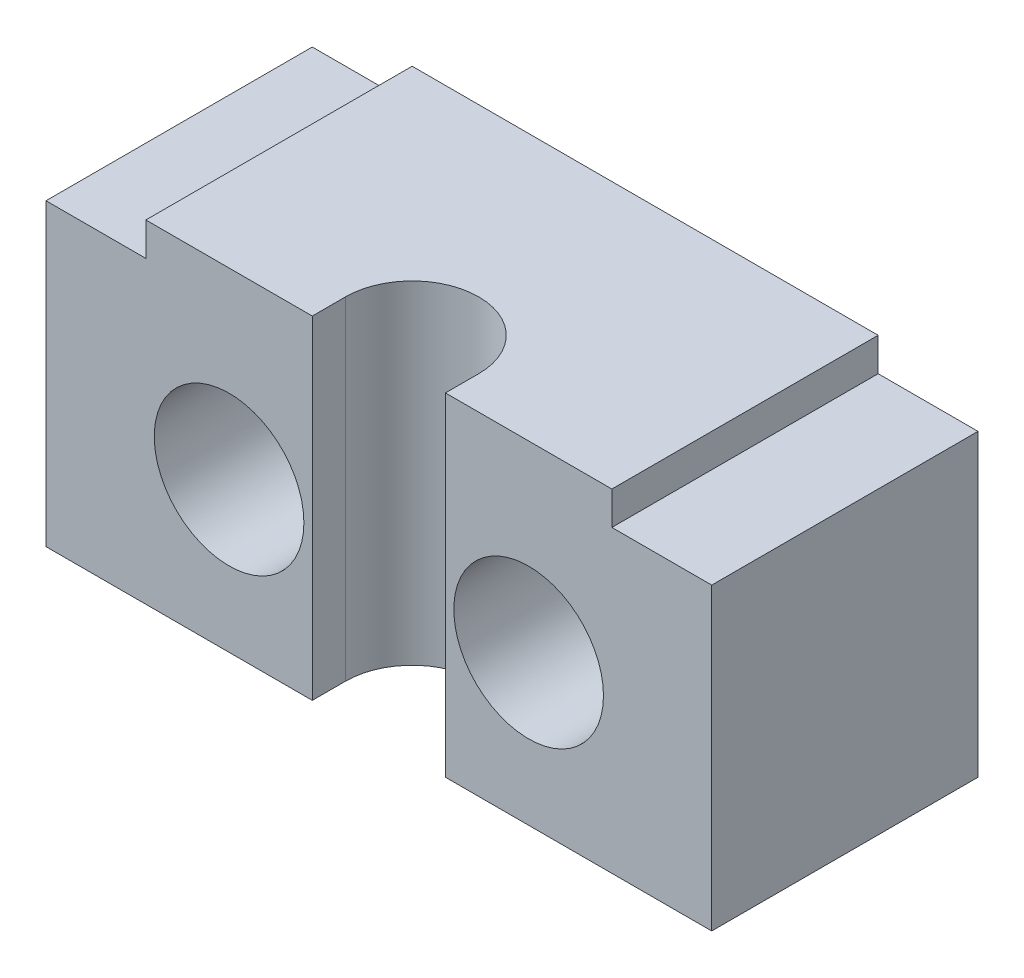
ISO-10303-21;
HEADER;
FILE_DESCRIPTION(('STEP AP214'),'2;1');
FILE_NAME('part.step','',(''),(''),'','','');
FILE_SCHEMA(('AUTOMOTIVE_DESIGN { 1 0 10303 214 1 1 1 1 }'));
ENDSEC;
DATA;
#1=APPLICATION_CONTEXT('core data for automotive mechanical design processes');
#2=APPLICATION_PROTOCOL_DEFINITION('international standard','automotive_design',2000,#1);
#3=PRODUCT_CONTEXT('',#1,'mechanical');
#4=PRODUCT('Part','Part','',(#3));
#5=PRODUCT_RELATED_PRODUCT_CATEGORY('part','',(#4));
#6=PRODUCT_DEFINITION_FORMATION('','',#4);
#7=PRODUCT_DEFINITION_CONTEXT('part definition',#1,'design');
#8=PRODUCT_DEFINITION('design','',#6,#7);
#9=PRODUCT_DEFINITION_SHAPE('','',#8);
#10=(LENGTH_UNIT() NAMED_UNIT(*) SI_UNIT(.MILLI.,.METRE.));
#11=(NAMED_UNIT(*) PLANE_ANGLE_UNIT() SI_UNIT($,.RADIAN.));
#12=(NAMED_UNIT(*) SI_UNIT($,.STERADIAN.) SOLID_ANGLE_UNIT());
#13=UNCERTAINTY_MEASURE_WITH_UNIT(LENGTH_MEASURE(1.E-05),#10,'distance_accuracy_value','');
#14=(GEOMETRIC_REPRESENTATION_CONTEXT(3) GLOBAL_UNCERTAINTY_ASSIGNED_CONTEXT((#13)) GLOBAL_UNIT_ASSIGNED_CONTEXT((#10,
#11,#12)) REPRESENTATION_CONTEXT('',''));
#15=CARTESIAN_POINT('',(0.,0.,0.));
#16=DIRECTION('',(0.,0.,1.));
#17=DIRECTION('',(1.,0.,0.));
#18=AXIS2_PLACEMENT_3D('',#15,#16,#17);
#19=CARTESIAN_POINT('',(0.,0.,25.4));
#20=DIRECTION('',(0.,0.,1.));
#21=DIRECTION('',(1.,0.,0.));
#22=AXIS2_PLACEMENT_3D('',#19,#20,#21);
#23=PLANE('',#22);
#24=CARTESIAN_POINT('',(14.2875,14.2748,25.4));
#25=DIRECTION('',(0.,0.,1.));
#26=DIRECTION('',(1.,0.,0.));
#27=AXIS2_PLACEMENT_3D('',#24,#25,#26);
#28=CIRCLE('',#27,7.1374);
#29=CARTESIAN_POINT('',(21.4249,14.2748,25.4));
#30=VERTEX_POINT('',#29);
#31=EDGE_CURVE('E184',#30,#30,#28,.F.);
#32=ORIENTED_EDGE('',*,*,#31,.T.);
#33=EDGE_LOOP('',(#32));
#34=FACE_BOUND('',#33,.T.);
#35=DIRECTION('',(-1.,0.,0.));
#36=VECTOR('',#35,1.);
#37=CARTESIAN_POINT('',(22.225,31.75,25.4));
#38=LINE('',#37,#36);
#39=CARTESIAN_POINT('',(22.225,31.75,25.4));
#40=VERTEX_POINT('',#39);
#41=CARTESIAN_POINT('',(6.35,31.75,25.4));
#42=VERTEX_POINT('',#41);
#43=EDGE_CURVE('E127',#40,#42,#38,.T.);
#44=ORIENTED_EDGE('',*,*,#43,.T.);
#45=DIRECTION('',(0.,-1.,0.));
#46=VECTOR('',#45,1.);
#47=CARTESIAN_POINT('',(6.35,0.,25.4));
#48=LINE('',#47,#46);
#49=CARTESIAN_POINT('',(6.35,0.,25.4));
#50=VERTEX_POINT('',#49);
#51=EDGE_CURVE('E218',#42,#50,#48,.T.);
#52=ORIENTED_EDGE('',*,*,#51,.T.);
#53=DIRECTION('',(1.,0.,0.));
#54=VECTOR('',#53,1.);
#55=CARTESIAN_POINT('',(-31.75,0.,25.4));
#56=LINE('',#55,#54);
#57=CARTESIAN_POINT('',(31.75,0.,25.4));
#58=VERTEX_POINT('',#57);
#59=EDGE_CURVE('E241',#50,#58,#56,.T.);
#60=ORIENTED_EDGE('',*,*,#59,.T.);
#61=DIRECTION('',(0.,1.,0.));
#62=VECTOR('',#61,1.);
#63=CARTESIAN_POINT('',(31.75,0.,25.4));
#64=LINE('',#63,#62);
#65=CARTESIAN_POINT('',(31.75,28.575,25.4));
#66=VERTEX_POINT('',#65);
#67=EDGE_CURVE('E247',#58,#66,#64,.T.);
#68=ORIENTED_EDGE('',*,*,#67,.T.);
#69=DIRECTION('',(-1.,0.,0.));
#70=VECTOR('',#69,1.);
#71=CARTESIAN_POINT('',(31.75,28.575,25.4));
#72=LINE('',#71,#70);
#73=CARTESIAN_POINT('',(22.225,28.575,25.4));
#74=VERTEX_POINT('',#73);
#75=EDGE_CURVE('E227',#66,#74,#72,.T.);
#76=ORIENTED_EDGE('',*,*,#75,.T.);
#77=DIRECTION('',(0.,1.,0.));
#78=VECTOR('',#77,1.);
#79=CARTESIAN_POINT('',(22.225,28.575,25.4));
#80=LINE('',#79,#78);
#81=EDGE_CURVE('E128',#74,#40,#80,.T.);
#82=ORIENTED_EDGE('',*,*,#81,.T.);
#83=EDGE_LOOP('',(#44,#52,#60,#68,#76,#82));
#84=FACE_BOUND('',#83,.T.);
#85=ADVANCED_FACE('F33',(#34,#84),#23,.T.);
#86=CARTESIAN_POINT('',(-14.2875,14.2748,25.4));
#87=DIRECTION('',(0.,0.,1.));
#88=DIRECTION('',(1.,0.,0.));
#89=AXIS2_PLACEMENT_3D('',#86,#87,#88);
#90=CIRCLE('',#89,7.1374);
#91=CARTESIAN_POINT('',(-7.1501,14.2748,25.4));
#92=VERTEX_POINT('',#91);
#93=EDGE_CURVE('E192',#92,#92,#90,.F.);
#94=ORIENTED_EDGE('',*,*,#93,.T.);
#95=EDGE_LOOP('',(#94));
#96=FACE_BOUND('',#95,.T.);
#97=CARTESIAN_POINT('',(-31.75,0.,25.4));
#98=VERTEX_POINT('',#97);
#99=CARTESIAN_POINT('',(-6.35,0.,25.4));
#100=VERTEX_POINT('',#99);
#101=EDGE_CURVE('E99',#98,#100,#56,.T.);
#102=ORIENTED_EDGE('',*,*,#101,.T.);
#103=DIRECTION('',(0.,1.,0.));
#104=VECTOR('',#103,1.);
#105=CARTESIAN_POINT('',(-6.35,0.,25.4));
#106=LINE('',#105,#104);
#107=CARTESIAN_POINT('',(-6.35,31.75,25.4));
#108=VERTEX_POINT('',#107);
#109=EDGE_CURVE('E124',#100,#108,#106,.T.);
#110=ORIENTED_EDGE('',*,*,#109,.T.);
#111=CARTESIAN_POINT('',(-22.225,31.75,25.4));
#112=VERTEX_POINT('',#111);
#113=EDGE_CURVE('E116',#108,#112,#38,.T.);
#114=ORIENTED_EDGE('',*,*,#113,.T.);
#115=DIRECTION('',(0.,-1.,0.));
#116=VECTOR('',#115,1.);
#117=CARTESIAN_POINT('',(-22.225,31.75,25.4));
#118=LINE('',#117,#116);
#119=CARTESIAN_POINT('',(-22.225,28.575,25.4));
#120=VERTEX_POINT('',#119);
#121=EDGE_CURVE('E120',#112,#120,#118,.T.);
#122=ORIENTED_EDGE('',*,*,#121,.T.);
#123=DIRECTION('',(-1.,0.,0.));
#124=VECTOR('',#123,1.);
#125=CARTESIAN_POINT('',(-22.225,28.575,25.4));
#126=LINE('',#125,#124);
#127=CARTESIAN_POINT('',(-31.75,28.575,25.4));
#128=VERTEX_POINT('',#127);
#129=EDGE_CURVE('E57',#120,#128,#126,.T.);
#130=ORIENTED_EDGE('',*,*,#129,.T.);
#131=DIRECTION('',(0.,-1.,0.));
#132=VECTOR('',#131,1.);
#133=CARTESIAN_POINT('',(-31.75,28.575,25.4));
#134=LINE('',#133,#132);
#135=EDGE_CURVE('E165',#128,#98,#134,.T.);
#136=ORIENTED_EDGE('',*,*,#135,.T.);
#137=EDGE_LOOP('',(#102,#110,#114,#122,#130,#136));
#138=FACE_BOUND('',#137,.T.);
#139=ADVANCED_FACE('F118',(#96,#138),#23,.T.);
#140=CARTESIAN_POINT('',(0.,0.,25.4));
#141=DIRECTION('',(0.,1.,0.));
#142=DIRECTION('',(0.,0.,1.));
#143=AXIS2_PLACEMENT_3D('',#140,#141,#142);
#144=PLANE('',#143);
#145=DIRECTION('',(0.,0.,-1.));
#146=VECTOR('',#145,1.);
#147=CARTESIAN_POINT('',(6.35,0.,34.925));
#148=LINE('',#147,#146);
#149=CARTESIAN_POINT('',(6.35,0.,22.225));
#150=VERTEX_POINT('',#149);
#151=EDGE_CURVE('E216',#50,#150,#148,.T.);
#152=ORIENTED_EDGE('',*,*,#151,.T.);
#153=CARTESIAN_POINT('',(0.,0.,22.225));
#154=DIRECTION('',(0.,1.,0.));
#155=DIRECTION('',(0.,0.,1.));
#156=AXIS2_PLACEMENT_3D('',#153,#154,#155);
#157=CIRCLE('',#156,6.35);
#158=CARTESIAN_POINT('',(-6.35,0.,22.225));
#159=VERTEX_POINT('',#158);
#160=EDGE_CURVE('E392',#150,#159,#157,.T.);
#161=ORIENTED_EDGE('',*,*,#160,.T.);
#162=DIRECTION('',(0.,0.,1.));
#163=VECTOR('',#162,1.);
#164=CARTESIAN_POINT('',(-6.35,0.,34.925));
#165=LINE('',#164,#163);
#166=EDGE_CURVE('E390',#159,#100,#165,.T.);
#167=ORIENTED_EDGE('',*,*,#166,.T.);
#168=ORIENTED_EDGE('',*,*,#101,.F.);
#169=DIRECTION('',(0.,0.,-1.));
#170=VECTOR('',#169,1.);
#171=CARTESIAN_POINT('',(-31.75,0.,25.4));
#172=LINE('',#171,#170);
#173=CARTESIAN_POINT('',(-31.75,0.,0.));
#174=VERTEX_POINT('',#173);
#175=EDGE_CURVE('E178',#98,#174,#172,.T.);
#176=ORIENTED_EDGE('',*,*,#175,.T.);
#177=DIRECTION('',(1.,0.,0.));
#178=VECTOR('',#177,1.);
#179=CARTESIAN_POINT('',(0.,0.,0.));
#180=LINE('',#179,#178);
#181=CARTESIAN_POINT('',(31.75,0.,0.));
#182=VERTEX_POINT('',#181);
#183=EDGE_CURVE('E152',#174,#182,#180,.T.);
#184=ORIENTED_EDGE('',*,*,#183,.T.);
#185=DIRECTION('',(0.,0.,-1.));
#186=VECTOR('',#185,1.);
#187=CARTESIAN_POINT('',(31.75,0.,25.4));
#188=LINE('',#187,#186);
#189=EDGE_CURVE('E175',#58,#182,#188,.T.);
#190=ORIENTED_EDGE('',*,*,#189,.F.);
#191=ORIENTED_EDGE('',*,*,#59,.F.);
#192=EDGE_LOOP('',(#152,#161,#167,#168,#176,#184,#190,#191));
#193=FACE_BOUND('',#192,.T.);
#194=ADVANCED_FACE('F257',(#193),#144,.F.);
#195=CARTESIAN_POINT('',(22.225,31.75,25.4));
#196=DIRECTION('',(0.,-1.,0.));
#197=DIRECTION('',(0.,0.,-1.));
#198=AXIS2_PLACEMENT_3D('',#195,#196,#197);
#199=PLANE('',#198);
#200=DIRECTION('',(0.,0.,-1.));
#201=VECTOR('',#200,1.);
#202=CARTESIAN_POINT('',(6.35,31.75,25.4));
#203=LINE('',#202,#201);
#204=CARTESIAN_POINT('',(6.35,31.75,22.225));
#205=VERTEX_POINT('',#204);
#206=EDGE_CURVE('E11',#42,#205,#203,.T.);
#207=ORIENTED_EDGE('',*,*,#206,.F.);
#208=ORIENTED_EDGE('',*,*,#43,.F.);
#209=DIRECTION('',(0.,0.,-1.));
#210=VECTOR('',#209,1.);
#211=CARTESIAN_POINT('',(22.225,31.75,25.4));
#212=LINE('',#211,#210);
#213=CARTESIAN_POINT('',(22.225,31.75,0.));
#214=VERTEX_POINT('',#213);
#215=EDGE_CURVE('E139',#40,#214,#212,.T.);
#216=ORIENTED_EDGE('',*,*,#215,.T.);
#217=DIRECTION('',(-1.,0.,0.));
#218=VECTOR('',#217,1.);
#219=CARTESIAN_POINT('',(22.225,31.75,0.));
#220=LINE('',#219,#218);
#221=CARTESIAN_POINT('',(-22.225,31.75,0.));
#222=VERTEX_POINT('',#221);
#223=EDGE_CURVE('E136',#214,#222,#220,.T.);
#224=ORIENTED_EDGE('',*,*,#223,.T.);
#225=DIRECTION('',(0.,0.,-1.));
#226=VECTOR('',#225,1.);
#227=CARTESIAN_POINT('',(-22.225,31.75,25.4));
#228=LINE('',#227,#226);
#229=EDGE_CURVE('E131',#112,#222,#228,.T.);
#230=ORIENTED_EDGE('',*,*,#229,.F.);
#231=ORIENTED_EDGE('',*,*,#113,.F.);
#232=DIRECTION('',(0.,0.,1.));
#233=VECTOR('',#232,1.);
#234=CARTESIAN_POINT('',(-6.35,31.75,25.4));
#235=LINE('',#234,#233);
#236=CARTESIAN_POINT('',(-6.35,31.75,22.225));
#237=VERTEX_POINT('',#236);
#238=EDGE_CURVE('E180',#237,#108,#235,.T.);
#239=ORIENTED_EDGE('',*,*,#238,.F.);
#240=CARTESIAN_POINT('',(0.,31.75,22.225));
#241=DIRECTION('',(0.,-1.,0.));
#242=DIRECTION('',(0.,0.,-1.));
#243=AXIS2_PLACEMENT_3D('',#240,#241,#242);
#244=CIRCLE('',#243,6.35);
#245=EDGE_CURVE('E41',#205,#237,#244,.F.);
#246=ORIENTED_EDGE('',*,*,#245,.F.);
#247=EDGE_LOOP('',(#207,#208,#216,#224,#230,#231,#239,#246));
#248=FACE_BOUND('',#247,.T.);
#249=ADVANCED_FACE('F133',(#248),#199,.F.);
#250=CARTESIAN_POINT('',(-14.2875,14.2748,25.4));
#251=DIRECTION('',(0.,0.,-1.));
#252=DIRECTION('',(-1.,0.,0.));
#253=AXIS2_PLACEMENT_3D('',#250,#251,#252);
#254=CYLINDRICAL_SURFACE('',#253,4.7625);
#255=CARTESIAN_POINT('',(-14.2875,14.2748,0.));
#256=DIRECTION('',(0.,0.,1.));
#257=DIRECTION('',(1.,0.,0.));
#258=AXIS2_PLACEMENT_3D('',#255,#256,#257);
#259=CIRCLE('',#258,4.7625);
#260=CARTESIAN_POINT('',(-9.525,14.2748,0.));
#261=VERTEX_POINT('',#260);
#262=EDGE_CURVE('E153',#261,#261,#259,.T.);
#263=ORIENTED_EDGE('',*,*,#262,.F.);
#264=EDGE_LOOP('',(#263));
#265=FACE_BOUND('',#264,.T.);
#266=CARTESIAN_POINT('',(-14.2875,14.2748,11.1252));
#267=DIRECTION('',(0.,0.,1.));
#268=DIRECTION('',(1.,0.,0.));
#269=AXIS2_PLACEMENT_3D('',#266,#267,#268);
#270=CIRCLE('',#269,4.7625);
#271=CARTESIAN_POINT('',(-9.525,14.2748,11.1252));
#272=VERTEX_POINT('',#271);
#273=EDGE_CURVE('E189',#272,#272,#270,.T.);
#274=ORIENTED_EDGE('',*,*,#273,.T.);
#275=EDGE_LOOP('',(#274));
#276=FACE_BOUND('',#275,.T.);
#277=ADVANCED_FACE('F265',(#265,#276),#254,.F.);
#278=CARTESIAN_POINT('',(14.2875,14.2748,25.4));
#279=DIRECTION('',(0.,0.,-1.));
#280=DIRECTION('',(-1.,0.,0.));
#281=AXIS2_PLACEMENT_3D('',#278,#279,#280);
#282=CYLINDRICAL_SURFACE('',#281,4.7625);
#283=CARTESIAN_POINT('',(14.2875,14.2748,0.));
#284=DIRECTION('',(0.,0.,1.));
#285=DIRECTION('',(1.,0.,0.));
#286=AXIS2_PLACEMENT_3D('',#283,#284,#285);
#287=CIRCLE('',#286,4.7625);
#288=CARTESIAN_POINT('',(19.05,14.2748,0.));
#289=VERTEX_POINT('',#288);
#290=EDGE_CURVE('E188',#289,#289,#287,.T.);
#291=ORIENTED_EDGE('',*,*,#290,.F.);
#292=EDGE_LOOP('',(#291));
#293=FACE_BOUND('',#292,.T.);
#294=CARTESIAN_POINT('',(14.2875,14.2748,11.1252));
#295=DIRECTION('',(0.,0.,1.));
#296=DIRECTION('',(1.,0.,0.));
#297=AXIS2_PLACEMENT_3D('',#294,#295,#296);
#298=CIRCLE('',#297,4.7625);
#299=CARTESIAN_POINT('',(19.05,14.2748,11.1252));
#300=VERTEX_POINT('',#299);
#301=EDGE_CURVE('E181',#300,#300,#298,.T.);
#302=ORIENTED_EDGE('',*,*,#301,.T.);
#303=EDGE_LOOP('',(#302));
#304=FACE_BOUND('',#303,.T.);
#305=ADVANCED_FACE('F279',(#293,#304),#282,.F.);
#306=CARTESIAN_POINT('',(0.,0.,0.));
#307=DIRECTION('',(0.,0.,1.));
#308=DIRECTION('',(1.,0.,0.));
#309=AXIS2_PLACEMENT_3D('',#306,#307,#308);
#310=PLANE('',#309);
#311=ORIENTED_EDGE('',*,*,#262,.T.);
#312=EDGE_LOOP('',(#311));
#313=FACE_BOUND('',#312,.T.);
#314=DIRECTION('',(0.,-1.,0.));
#315=VECTOR('',#314,1.);
#316=CARTESIAN_POINT('',(-31.75,28.575,0.));
#317=LINE('',#316,#315);
#318=CARTESIAN_POINT('',(-31.75,28.575,0.));
#319=VERTEX_POINT('',#318);
#320=EDGE_CURVE('E149',#319,#174,#317,.T.);
#321=ORIENTED_EDGE('',*,*,#320,.F.);
#322=DIRECTION('',(-1.,0.,0.));
#323=VECTOR('',#322,1.);
#324=CARTESIAN_POINT('',(-22.225,28.575,0.));
#325=LINE('',#324,#323);
#326=CARTESIAN_POINT('',(-22.225,28.575,0.));
#327=VERTEX_POINT('',#326);
#328=EDGE_CURVE('E90',#327,#319,#325,.T.);
#329=ORIENTED_EDGE('',*,*,#328,.F.);
#330=DIRECTION('',(0.,-1.,0.));
#331=VECTOR('',#330,1.);
#332=CARTESIAN_POINT('',(-22.225,31.75,0.));
#333=LINE('',#332,#331);
#334=EDGE_CURVE('E162',#222,#327,#333,.T.);
#335=ORIENTED_EDGE('',*,*,#334,.F.);
#336=ORIENTED_EDGE('',*,*,#223,.F.);
#337=DIRECTION('',(0.,1.,0.));
#338=VECTOR('',#337,1.);
#339=CARTESIAN_POINT('',(22.225,28.575,0.));
#340=LINE('',#339,#338);
#341=CARTESIAN_POINT('',(22.225,28.575,0.));
#342=VERTEX_POINT('',#341);
#343=EDGE_CURVE('E159',#342,#214,#340,.T.);
#344=ORIENTED_EDGE('',*,*,#343,.F.);
#345=DIRECTION('',(-1.,0.,0.));
#346=VECTOR('',#345,1.);
#347=CARTESIAN_POINT('',(31.75,28.575,0.));
#348=LINE('',#347,#346);
#349=CARTESIAN_POINT('',(31.75,28.575,0.));
#350=VERTEX_POINT('',#349);
#351=EDGE_CURVE('E157',#350,#342,#348,.T.);
#352=ORIENTED_EDGE('',*,*,#351,.F.);
#353=DIRECTION('',(0.,1.,0.));
#354=VECTOR('',#353,1.);
#355=CARTESIAN_POINT('',(31.75,0.,0.));
#356=LINE('',#355,#354);
#357=EDGE_CURVE('E155',#182,#350,#356,.T.);
#358=ORIENTED_EDGE('',*,*,#357,.F.);
#359=ORIENTED_EDGE('',*,*,#183,.F.);
#360=EDGE_LOOP('',(#321,#329,#335,#336,#344,#352,#358,#359));
#361=FACE_BOUND('',#360,.T.);
#362=ORIENTED_EDGE('',*,*,#290,.T.);
#363=EDGE_LOOP('',(#362));
#364=FACE_BOUND('',#363,.T.);
#365=ADVANCED_FACE('F234',(#313,#361,#364),#310,.F.);
#366=CARTESIAN_POINT('',(-31.75,28.575,25.4));
#367=DIRECTION('',(1.,0.,0.));
#368=DIRECTION('',(0.,0.,-1.));
#369=AXIS2_PLACEMENT_3D('',#366,#367,#368);
#370=PLANE('',#369);
#371=ORIENTED_EDGE('',*,*,#320,.T.);
#372=ORIENTED_EDGE('',*,*,#175,.F.);
#373=ORIENTED_EDGE('',*,*,#135,.F.);
#374=DIRECTION('',(0.,0.,-1.));
#375=VECTOR('',#374,1.);
#376=CARTESIAN_POINT('',(-31.75,28.575,25.4));
#377=LINE('',#376,#375);
#378=EDGE_CURVE('E144',#128,#319,#377,.T.);
#379=ORIENTED_EDGE('',*,*,#378,.T.);
#380=EDGE_LOOP('',(#371,#372,#373,#379));
#381=FACE_BOUND('',#380,.T.);
#382=ADVANCED_FACE('F35',(#381),#370,.F.);
#383=CARTESIAN_POINT('',(31.75,0.,25.4));
#384=DIRECTION('',(-1.,0.,0.));
#385=DIRECTION('',(0.,0.,1.));
#386=AXIS2_PLACEMENT_3D('',#383,#384,#385);
#387=PLANE('',#386);
#388=ORIENTED_EDGE('',*,*,#357,.T.);
#389=DIRECTION('',(0.,0.,-1.));
#390=VECTOR('',#389,1.);
#391=CARTESIAN_POINT('',(31.75,28.575,25.4));
#392=LINE('',#391,#390);
#393=EDGE_CURVE('E172',#66,#350,#392,.T.);
#394=ORIENTED_EDGE('',*,*,#393,.F.);
#395=ORIENTED_EDGE('',*,*,#67,.F.);
#396=ORIENTED_EDGE('',*,*,#189,.T.);
#397=EDGE_LOOP('',(#388,#394,#395,#396));
#398=FACE_BOUND('',#397,.T.);
#399=ADVANCED_FACE('F253',(#398),#387,.F.);
#400=CARTESIAN_POINT('',(31.75,28.575,25.4));
#401=DIRECTION('',(0.,-1.,0.));
#402=DIRECTION('',(0.,0.,-1.));
#403=AXIS2_PLACEMENT_3D('',#400,#401,#402);
#404=PLANE('',#403);
#405=ORIENTED_EDGE('',*,*,#351,.T.);
#406=DIRECTION('',(0.,0.,-1.));
#407=VECTOR('',#406,1.);
#408=CARTESIAN_POINT('',(22.225,28.575,25.4));
#409=LINE('',#408,#407);
#410=EDGE_CURVE('E169',#74,#342,#409,.T.);
#411=ORIENTED_EDGE('',*,*,#410,.F.);
#412=ORIENTED_EDGE('',*,*,#75,.F.);
#413=ORIENTED_EDGE('',*,*,#393,.T.);
#414=EDGE_LOOP('',(#405,#411,#412,#413));
#415=FACE_BOUND('',#414,.T.);
#416=ADVANCED_FACE('F256',(#415),#404,.F.);
#417=CARTESIAN_POINT('',(22.225,28.575,25.4));
#418=DIRECTION('',(-1.,0.,0.));
#419=DIRECTION('',(0.,0.,1.));
#420=AXIS2_PLACEMENT_3D('',#417,#418,#419);
#421=PLANE('',#420);
#422=ORIENTED_EDGE('',*,*,#343,.T.);
#423=ORIENTED_EDGE('',*,*,#215,.F.);
#424=ORIENTED_EDGE('',*,*,#81,.F.);
#425=ORIENTED_EDGE('',*,*,#410,.T.);
#426=EDGE_LOOP('',(#422,#423,#424,#425));
#427=FACE_BOUND('',#426,.T.);
#428=ADVANCED_FACE('F230',(#427),#421,.F.);
#429=CARTESIAN_POINT('',(-22.225,31.75,25.4));
#430=DIRECTION('',(1.,0.,0.));
#431=DIRECTION('',(0.,0.,-1.));
#432=AXIS2_PLACEMENT_3D('',#429,#430,#431);
#433=PLANE('',#432);
#434=ORIENTED_EDGE('',*,*,#334,.T.);
#435=DIRECTION('',(0.,0.,-1.));
#436=VECTOR('',#435,1.);
#437=CARTESIAN_POINT('',(-22.225,28.575,25.4));
#438=LINE('',#437,#436);
#439=EDGE_CURVE('E140',#120,#327,#438,.T.);
#440=ORIENTED_EDGE('',*,*,#439,.F.);
#441=ORIENTED_EDGE('',*,*,#121,.F.);
#442=ORIENTED_EDGE('',*,*,#229,.T.);
#443=EDGE_LOOP('',(#434,#440,#441,#442));
#444=FACE_BOUND('',#443,.T.);
#445=ADVANCED_FACE('F142',(#444),#433,.F.);
#446=CARTESIAN_POINT('',(-22.225,28.575,25.4));
#447=DIRECTION('',(0.,-1.,0.));
#448=DIRECTION('',(0.,0.,-1.));
#449=AXIS2_PLACEMENT_3D('',#446,#447,#448);
#450=PLANE('',#449);
#451=ORIENTED_EDGE('',*,*,#328,.T.);
#452=ORIENTED_EDGE('',*,*,#378,.F.);
#453=ORIENTED_EDGE('',*,*,#129,.F.);
#454=ORIENTED_EDGE('',*,*,#439,.T.);
#455=EDGE_LOOP('',(#451,#452,#453,#454));
#456=FACE_BOUND('',#455,.T.);
#457=ADVANCED_FACE('F237',(#456),#450,.F.);
#458=CARTESIAN_POINT('',(14.2875,14.2748,36.5252));
#459=DIRECTION('',(0.,0.,-1.));
#460=DIRECTION('',(-1.,0.,0.));
#461=AXIS2_PLACEMENT_3D('',#458,#459,#460);
#462=CYLINDRICAL_SURFACE('',#461,7.1374);
#463=ORIENTED_EDGE('',*,*,#31,.F.);
#464=EDGE_LOOP('',(#463));
#465=FACE_BOUND('',#464,.T.);
#466=CARTESIAN_POINT('',(14.2875,14.2748,11.1252));
#467=DIRECTION('',(0.,0.,1.));
#468=DIRECTION('',(1.,0.,0.));
#469=AXIS2_PLACEMENT_3D('',#466,#467,#468);
#470=CIRCLE('',#469,7.1374);
#471=CARTESIAN_POINT('',(21.4249,14.2748,11.1252));
#472=VERTEX_POINT('',#471);
#473=EDGE_CURVE('E185',#472,#472,#470,.T.);
#474=ORIENTED_EDGE('',*,*,#473,.F.);
#475=EDGE_LOOP('',(#474));
#476=FACE_BOUND('',#475,.T.);
#477=ADVANCED_FACE('F283',(#465,#476),#462,.F.);
#478=CARTESIAN_POINT('',(14.2875,14.2748,11.1252));
#479=DIRECTION('',(0.,0.,1.));
#480=DIRECTION('',(1.,0.,0.));
#481=AXIS2_PLACEMENT_3D('',#478,#479,#480);
#482=PLANE('',#481);
#483=ORIENTED_EDGE('',*,*,#301,.F.);
#484=EDGE_LOOP('',(#483));
#485=FACE_BOUND('',#484,.T.);
#486=ORIENTED_EDGE('',*,*,#473,.T.);
#487=EDGE_LOOP('',(#486));
#488=FACE_BOUND('',#487,.T.);
#489=ADVANCED_FACE('F359',(#485,#488),#482,.T.);
#490=CARTESIAN_POINT('',(-14.2875,14.2748,36.5252));
#491=DIRECTION('',(0.,0.,-1.));
#492=DIRECTION('',(-1.,0.,0.));
#493=AXIS2_PLACEMENT_3D('',#490,#491,#492);
#494=CYLINDRICAL_SURFACE('',#493,7.1374);
#495=ORIENTED_EDGE('',*,*,#93,.F.);
#496=EDGE_LOOP('',(#495));
#497=FACE_BOUND('',#496,.T.);
#498=CARTESIAN_POINT('',(-14.2875,14.2748,11.1252));
#499=DIRECTION('',(0.,0.,1.));
#500=DIRECTION('',(1.,0.,0.));
#501=AXIS2_PLACEMENT_3D('',#498,#499,#500);
#502=CIRCLE('',#501,7.1374);
#503=CARTESIAN_POINT('',(-7.1501,14.2748,11.1252));
#504=VERTEX_POINT('',#503);
#505=EDGE_CURVE('E193',#504,#504,#502,.T.);
#506=ORIENTED_EDGE('',*,*,#505,.F.);
#507=EDGE_LOOP('',(#506));
#508=FACE_BOUND('',#507,.T.);
#509=ADVANCED_FACE('F355',(#497,#508),#494,.F.);
#510=CARTESIAN_POINT('',(-14.2875,14.2748,11.1252));
#511=DIRECTION('',(0.,0.,1.));
#512=DIRECTION('',(1.,0.,0.));
#513=AXIS2_PLACEMENT_3D('',#510,#511,#512);
#514=PLANE('',#513);
#515=ORIENTED_EDGE('',*,*,#273,.F.);
#516=EDGE_LOOP('',(#515));
#517=FACE_BOUND('',#516,.T.);
#518=ORIENTED_EDGE('',*,*,#505,.T.);
#519=EDGE_LOOP('',(#518));
#520=FACE_BOUND('',#519,.T.);
#521=ADVANCED_FACE('F331',(#517,#520),#514,.T.);
#522=CARTESIAN_POINT('',(0.,38.1,22.225));
#523=DIRECTION('',(0.,-1.,0.));
#524=DIRECTION('',(0.,0.,-1.));
#525=AXIS2_PLACEMENT_3D('',#522,#523,#524);
#526=CYLINDRICAL_SURFACE('',#525,6.35);
#527=ORIENTED_EDGE('',*,*,#245,.T.);
#528=DIRECTION('',(0.,-1.,0.));
#529=VECTOR('',#528,1.);
#530=CARTESIAN_POINT('',(-6.35,38.1,22.225));
#531=LINE('',#530,#529);
#532=EDGE_CURVE('E48',#237,#159,#531,.T.);
#533=ORIENTED_EDGE('',*,*,#532,.T.);
#534=ORIENTED_EDGE('',*,*,#160,.F.);
#535=DIRECTION('',(0.,-1.,0.));
#536=VECTOR('',#535,1.);
#537=CARTESIAN_POINT('',(6.35,38.1,22.225));
#538=LINE('',#537,#536);
#539=EDGE_CURVE('E204',#205,#150,#538,.T.);
#540=ORIENTED_EDGE('',*,*,#539,.F.);
#541=EDGE_LOOP('',(#527,#533,#534,#540));
#542=FACE_BOUND('',#541,.T.);
#543=ADVANCED_FACE('F199',(#542),#526,.F.);
#544=CARTESIAN_POINT('',(6.35,38.1,34.925));
#545=DIRECTION('',(-1.,0.,0.));
#546=DIRECTION('',(0.,0.,1.));
#547=AXIS2_PLACEMENT_3D('',#544,#545,#546);
#548=PLANE('',#547);
#549=ORIENTED_EDGE('',*,*,#206,.T.);
#550=ORIENTED_EDGE('',*,*,#539,.T.);
#551=ORIENTED_EDGE('',*,*,#151,.F.);
#552=ORIENTED_EDGE('',*,*,#51,.F.);
#553=EDGE_LOOP('',(#549,#550,#551,#552));
#554=FACE_BOUND('',#553,.T.);
#555=ADVANCED_FACE('F219',(#554),#548,.T.);
#556=CARTESIAN_POINT('',(-6.35,38.1,34.925));
#557=DIRECTION('',(1.,0.,0.));
#558=DIRECTION('',(0.,0.,-1.));
#559=AXIS2_PLACEMENT_3D('',#556,#557,#558);
#560=PLANE('',#559);
#561=ORIENTED_EDGE('',*,*,#166,.F.);
#562=ORIENTED_EDGE('',*,*,#532,.F.);
#563=ORIENTED_EDGE('',*,*,#238,.T.);
#564=ORIENTED_EDGE('',*,*,#109,.F.);
#565=EDGE_LOOP('',(#561,#562,#563,#564));
#566=FACE_BOUND('',#565,.T.);
#567=ADVANCED_FACE('F205',(#566),#560,.T.);
#568=CLOSED_SHELL('',(#85,#139,#194,#249,#277,#305,#365,#382,#399,#416,#428,#445,#457,#477,#489,
#509,#521,#543,#555,#567));
#569=MANIFOLD_SOLID_BREP('B2',#568);
#570=ADVANCED_BREP_SHAPE_REPRESENTATION('',(#18,#569),#14);
#571=SHAPE_DEFINITION_REPRESENTATION(#9,#570);
ENDSEC;
END-ISO-10303-21;
